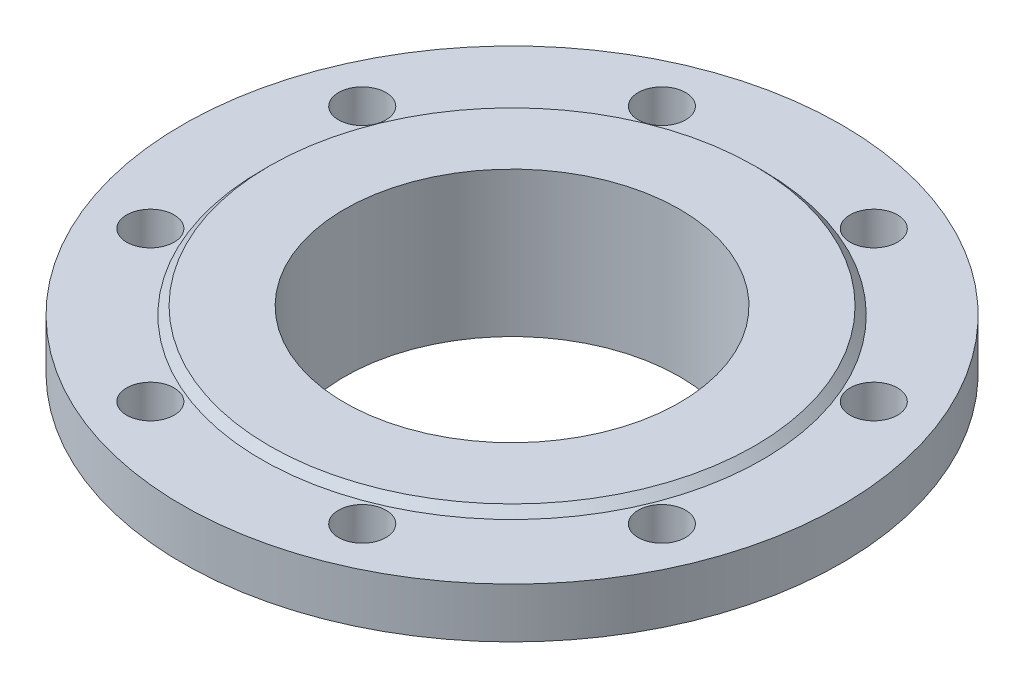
ISO-10303-21;
HEADER;
FILE_DESCRIPTION(('STEP AP214'),'2;1');
FILE_NAME('part.step','',(''),(''),'','','');
FILE_SCHEMA(('AUTOMOTIVE_DESIGN { 1 0 10303 214 1 1 1 1 }'));
ENDSEC;
DATA;
#1=APPLICATION_CONTEXT('core data for automotive mechanical design processes');
#2=APPLICATION_PROTOCOL_DEFINITION('international standard','automotive_design',2000,#1);
#3=PRODUCT_CONTEXT('',#1,'mechanical');
#4=PRODUCT('Part','Part','',(#3));
#5=PRODUCT_RELATED_PRODUCT_CATEGORY('part','',(#4));
#6=PRODUCT_DEFINITION_FORMATION('','',#4);
#7=PRODUCT_DEFINITION_CONTEXT('part definition',#1,'design');
#8=PRODUCT_DEFINITION('design','',#6,#7);
#9=PRODUCT_DEFINITION_SHAPE('','',#8);
#10=(LENGTH_UNIT() NAMED_UNIT(*) SI_UNIT(.MILLI.,.METRE.));
#11=(NAMED_UNIT(*) PLANE_ANGLE_UNIT() SI_UNIT($,.RADIAN.));
#12=(NAMED_UNIT(*) SI_UNIT($,.STERADIAN.) SOLID_ANGLE_UNIT());
#13=UNCERTAINTY_MEASURE_WITH_UNIT(LENGTH_MEASURE(1.E-05),#10,'distance_accuracy_value','');
#14=(GEOMETRIC_REPRESENTATION_CONTEXT(3) GLOBAL_UNCERTAINTY_ASSIGNED_CONTEXT((#13)) GLOBAL_UNIT_ASSIGNED_CONTEXT((#10,
#11,#12)) REPRESENTATION_CONTEXT('',''));
#15=CARTESIAN_POINT('',(0.,0.,0.));
#16=DIRECTION('',(0.,0.,1.));
#17=DIRECTION('',(1.,0.,0.));
#18=AXIS2_PLACEMENT_3D('',#15,#16,#17);
#19=CARTESIAN_POINT('',(-336.45,375.,0.));
#20=DIRECTION('',(0.,-1.,0.));
#21=DIRECTION('',(0.,0.,-1.));
#22=AXIS2_PLACEMENT_3D('',#19,#20,#21);
#23=PLANE('',#22);
#24=CARTESIAN_POINT('',(-400.,375.,0.));
#25=DIRECTION('',(0.,-1.,0.));
#26=DIRECTION('',(0.,0.,-1.));
#27=AXIS2_PLACEMENT_3D('',#24,#25,#26);
#28=CIRCLE('',#27,69.85);
#29=CARTESIAN_POINT('',(-400.,375.,-69.85));
#30=VERTEX_POINT('',#29);
#31=EDGE_CURVE('E12',#30,#30,#28,.T.);
#32=ORIENTED_EDGE('',*,*,#31,.T.);
#33=EDGE_LOOP('',(#32));
#34=FACE_BOUND('',#33,.T.);
#35=CARTESIAN_POINT('',(-400.,375.,0.));
#36=DIRECTION('',(0.,-1.,0.));
#37=DIRECTION('',(0.,0.,-1.));
#38=AXIS2_PLACEMENT_3D('',#35,#36,#37);
#39=CIRCLE('',#38,63.55);
#40=CARTESIAN_POINT('',(-400.,375.,-63.55));
#41=VERTEX_POINT('',#40);
#42=EDGE_CURVE('E73',#41,#41,#39,.T.);
#43=ORIENTED_EDGE('',*,*,#42,.F.);
#44=EDGE_LOOP('',(#43));
#45=FACE_BOUND('',#44,.T.);
#46=ADVANCED_FACE('F42',(#34,#45),#23,.T.);
#47=CARTESIAN_POINT('',(-400.,375.,0.));
#48=DIRECTION('',(0.,-1.,0.));
#49=DIRECTION('',(0.,0.,-1.));
#50=AXIS2_PLACEMENT_3D('',#47,#48,#49);
#51=CYLINDRICAL_SURFACE('',#50,69.85);
#52=CARTESIAN_POINT('',(-400.,387.,0.));
#53=DIRECTION('',(0.,-1.,0.));
#54=DIRECTION('',(0.,0.,-1.));
#55=AXIS2_PLACEMENT_3D('',#52,#53,#54);
#56=CIRCLE('',#55,69.85);
#57=CARTESIAN_POINT('',(-400.,387.,-69.85));
#58=VERTEX_POINT('',#57);
#59=EDGE_CURVE('E48',#58,#58,#56,.T.);
#60=ORIENTED_EDGE('',*,*,#59,.T.);
#61=EDGE_LOOP('',(#60));
#62=FACE_BOUND('',#61,.T.);
#63=ORIENTED_EDGE('',*,*,#31,.F.);
#64=EDGE_LOOP('',(#63));
#65=FACE_BOUND('',#64,.T.);
#66=ADVANCED_FACE('F166',(#62,#65),#51,.T.);
#67=CARTESIAN_POINT('',(-400.,387.,0.));
#68=DIRECTION('',(0.,1.,0.));
#69=DIRECTION('',(0.,0.,1.));
#70=AXIS2_PLACEMENT_3D('',#67,#68,#69);
#71=CONICAL_SURFACE('',#70,69.85,0.410910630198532);
#72=CARTESIAN_POINT('',(-400.,408.,0.));
#73=DIRECTION('',(0.,-1.,0.));
#74=DIRECTION('',(0.,0.,-1.));
#75=AXIS2_PLACEMENT_3D('',#72,#73,#74);
#76=CIRCLE('',#75,79.);
#77=CARTESIAN_POINT('',(-400.,408.,-79.));
#78=VERTEX_POINT('',#77);
#79=EDGE_CURVE('E52',#78,#78,#76,.T.);
#80=ORIENTED_EDGE('',*,*,#79,.T.);
#81=EDGE_LOOP('',(#80));
#82=FACE_BOUND('',#81,.T.);
#83=ORIENTED_EDGE('',*,*,#59,.F.);
#84=EDGE_LOOP('',(#83));
#85=FACE_BOUND('',#84,.T.);
#86=ADVANCED_FACE('F159',(#82,#85),#71,.T.);
#87=CARTESIAN_POINT('',(-321.,408.,0.));
#88=DIRECTION('',(0.,-1.,0.));
#89=DIRECTION('',(0.,0.,-1.));
#90=AXIS2_PLACEMENT_3D('',#87,#88,#89);
#91=PLANE('',#90);
#92=CARTESIAN_POINT('',(-359.818239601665,408.,-97.0073509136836));
#93=DIRECTION('',(0.,-1.,0.));
#94=DIRECTION('',(0.,0.,-1.));
#95=AXIS2_PLACEMENT_3D('',#92,#93,#94);
#96=CIRCLE('',#95,8.99999999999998);
#97=CARTESIAN_POINT('',(-359.818239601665,408.,-106.007350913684));
#98=VERTEX_POINT('',#97);
#99=EDGE_CURVE('E118',#98,#98,#96,.T.);
#100=ORIENTED_EDGE('',*,*,#99,.F.);
#101=EDGE_LOOP('',(#100));
#102=FACE_BOUND('',#101,.T.);
#103=CARTESIAN_POINT('',(-440.181760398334,408.,-97.007350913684));
#104=DIRECTION('',(0.,-1.,0.));
#105=DIRECTION('',(0.,0.,-1.));
#106=AXIS2_PLACEMENT_3D('',#103,#104,#105);
#107=CIRCLE('',#106,8.99999999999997);
#108=CARTESIAN_POINT('',(-440.181760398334,408.,-106.007350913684));
#109=VERTEX_POINT('',#108);
#110=EDGE_CURVE('E112',#109,#109,#107,.T.);
#111=ORIENTED_EDGE('',*,*,#110,.F.);
#112=EDGE_LOOP('',(#111));
#113=FACE_BOUND('',#112,.T.);
#114=CARTESIAN_POINT('',(-497.007350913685,408.,-40.1817603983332));
#115=DIRECTION('',(0.,-1.,0.));
#116=DIRECTION('',(0.,0.,-1.));
#117=AXIS2_PLACEMENT_3D('',#114,#115,#116);
#118=CIRCLE('',#117,8.99999999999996);
#119=CARTESIAN_POINT('',(-497.007350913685,408.,-49.1817603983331));
#120=VERTEX_POINT('',#119);
#121=EDGE_CURVE('E106',#120,#120,#118,.T.);
#122=ORIENTED_EDGE('',*,*,#121,.F.);
#123=EDGE_LOOP('',(#122));
#124=FACE_BOUND('',#123,.T.);
#125=CARTESIAN_POINT('',(-497.007350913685,408.,40.1817603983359));
#126=DIRECTION('',(0.,-1.,0.));
#127=DIRECTION('',(0.,0.,-1.));
#128=AXIS2_PLACEMENT_3D('',#125,#126,#127);
#129=CIRCLE('',#128,9.00000000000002);
#130=CARTESIAN_POINT('',(-497.007350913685,408.,31.1817603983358));
#131=VERTEX_POINT('',#130);
#132=EDGE_CURVE('E100',#131,#131,#129,.T.);
#133=ORIENTED_EDGE('',*,*,#132,.F.);
#134=EDGE_LOOP('',(#133));
#135=FACE_BOUND('',#134,.T.);
#136=CARTESIAN_POINT('',(-440.181760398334,408.,97.0073509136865));
#137=DIRECTION('',(0.,-1.,0.));
#138=DIRECTION('',(0.,0.,-1.));
#139=AXIS2_PLACEMENT_3D('',#136,#137,#138);
#140=CIRCLE('',#139,9.);
#141=CARTESIAN_POINT('',(-440.181760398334,408.,88.0073509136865));
#142=VERTEX_POINT('',#141);
#143=EDGE_CURVE('E94',#142,#142,#140,.T.);
#144=ORIENTED_EDGE('',*,*,#143,.F.);
#145=EDGE_LOOP('',(#144));
#146=FACE_BOUND('',#145,.T.);
#147=CARTESIAN_POINT('',(-359.818239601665,408.,97.0073509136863));
#148=DIRECTION('',(0.,-1.,0.));
#149=DIRECTION('',(0.,0.,-1.));
#150=AXIS2_PLACEMENT_3D('',#147,#148,#149);
#151=CIRCLE('',#150,8.99999999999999);
#152=CARTESIAN_POINT('',(-359.818239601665,408.,88.0073509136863));
#153=VERTEX_POINT('',#152);
#154=EDGE_CURVE('E88',#153,#153,#151,.T.);
#155=ORIENTED_EDGE('',*,*,#154,.F.);
#156=EDGE_LOOP('',(#155));
#157=FACE_BOUND('',#156,.T.);
#158=CARTESIAN_POINT('',(-302.992649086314,408.,40.1817603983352));
#159=DIRECTION('',(0.,-1.,0.));
#160=DIRECTION('',(0.,0.,-1.));
#161=AXIS2_PLACEMENT_3D('',#158,#159,#160);
#162=CIRCLE('',#161,9.);
#163=CARTESIAN_POINT('',(-302.992649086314,408.,31.1817603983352));
#164=VERTEX_POINT('',#163);
#165=EDGE_CURVE('E82',#164,#164,#162,.T.);
#166=ORIENTED_EDGE('',*,*,#165,.F.);
#167=EDGE_LOOP('',(#166));
#168=FACE_BOUND('',#167,.T.);
#169=CARTESIAN_POINT('',(-302.992649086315,408.,-40.1817603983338));
#170=DIRECTION('',(0.,-1.,0.));
#171=DIRECTION('',(0.,0.,-1.));
#172=AXIS2_PLACEMENT_3D('',#169,#170,#171);
#173=CIRCLE('',#172,8.99999999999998);
#174=CARTESIAN_POINT('',(-302.992649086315,408.,-49.1817603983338));
#175=VERTEX_POINT('',#174);
#176=EDGE_CURVE('E76',#175,#175,#173,.T.);
#177=ORIENTED_EDGE('',*,*,#176,.F.);
#178=EDGE_LOOP('',(#177));
#179=FACE_BOUND('',#178,.T.);
#180=CARTESIAN_POINT('',(-400.,408.,0.));
#181=DIRECTION('',(0.,-1.,0.));
#182=DIRECTION('',(0.,0.,-1.));
#183=AXIS2_PLACEMENT_3D('',#180,#181,#182);
#184=CIRCLE('',#183,125.);
#185=CARTESIAN_POINT('',(-400.,408.,-125.));
#186=VERTEX_POINT('',#185);
#187=EDGE_CURVE('E56',#186,#186,#184,.T.);
#188=ORIENTED_EDGE('',*,*,#187,.T.);
#189=EDGE_LOOP('',(#188));
#190=FACE_BOUND('',#189,.T.);
#191=ORIENTED_EDGE('',*,*,#79,.F.);
#192=EDGE_LOOP('',(#191));
#193=FACE_BOUND('',#192,.T.);
#194=ADVANCED_FACE('F153',(#102,#113,#124,#135,#146,#157,#168,#179,#190,#193),#91,.T.);
#195=CARTESIAN_POINT('',(-400.,375.,0.));
#196=DIRECTION('',(0.,-1.,0.));
#197=DIRECTION('',(0.,0.,-1.));
#198=AXIS2_PLACEMENT_3D('',#195,#196,#197);
#199=CYLINDRICAL_SURFACE('',#198,125.);
#200=CARTESIAN_POINT('',(-400.,427.,0.));
#201=DIRECTION('',(0.,-1.,0.));
#202=DIRECTION('',(0.,0.,-1.));
#203=AXIS2_PLACEMENT_3D('',#200,#201,#202);
#204=CIRCLE('',#203,125.);
#205=CARTESIAN_POINT('',(-400.,427.,-125.));
#206=VERTEX_POINT('',#205);
#207=EDGE_CURVE('E61',#206,#206,#204,.T.);
#208=ORIENTED_EDGE('',*,*,#207,.T.);
#209=EDGE_LOOP('',(#208));
#210=FACE_BOUND('',#209,.T.);
#211=ORIENTED_EDGE('',*,*,#187,.F.);
#212=EDGE_LOOP('',(#211));
#213=FACE_BOUND('',#212,.T.);
#214=ADVANCED_FACE('F131',(#210,#213),#199,.T.);
#215=CARTESIAN_POINT('',(-275.,427.,0.));
#216=DIRECTION('',(0.,1.,0.));
#217=DIRECTION('',(0.,0.,1.));
#218=AXIS2_PLACEMENT_3D('',#215,#216,#217);
#219=PLANE('',#218);
#220=CARTESIAN_POINT('',(-359.818239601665,427.,-97.0073509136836));
#221=DIRECTION('',(0.,1.,0.));
#222=DIRECTION('',(0.,0.,1.));
#223=AXIS2_PLACEMENT_3D('',#220,#221,#222);
#224=CIRCLE('',#223,8.99999999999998);
#225=CARTESIAN_POINT('',(-359.818239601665,427.,-88.0073509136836));
#226=VERTEX_POINT('',#225);
#227=EDGE_CURVE('E121',#226,#226,#224,.T.);
#228=ORIENTED_EDGE('',*,*,#227,.F.);
#229=EDGE_LOOP('',(#228));
#230=FACE_BOUND('',#229,.T.);
#231=CARTESIAN_POINT('',(-440.181760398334,427.,-97.007350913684));
#232=DIRECTION('',(0.,1.,0.));
#233=DIRECTION('',(0.,0.,1.));
#234=AXIS2_PLACEMENT_3D('',#231,#232,#233);
#235=CIRCLE('',#234,8.99999999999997);
#236=CARTESIAN_POINT('',(-440.181760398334,427.,-88.007350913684));
#237=VERTEX_POINT('',#236);
#238=EDGE_CURVE('E115',#237,#237,#235,.T.);
#239=ORIENTED_EDGE('',*,*,#238,.F.);
#240=EDGE_LOOP('',(#239));
#241=FACE_BOUND('',#240,.T.);
#242=CARTESIAN_POINT('',(-497.007350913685,427.,-40.1817603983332));
#243=DIRECTION('',(0.,1.,0.));
#244=DIRECTION('',(0.,0.,1.));
#245=AXIS2_PLACEMENT_3D('',#242,#243,#244);
#246=CIRCLE('',#245,8.99999999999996);
#247=CARTESIAN_POINT('',(-497.007350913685,427.,-31.1817603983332));
#248=VERTEX_POINT('',#247);
#249=EDGE_CURVE('E109',#248,#248,#246,.T.);
#250=ORIENTED_EDGE('',*,*,#249,.F.);
#251=EDGE_LOOP('',(#250));
#252=FACE_BOUND('',#251,.T.);
#253=CARTESIAN_POINT('',(-497.007350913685,427.,40.1817603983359));
#254=DIRECTION('',(0.,1.,0.));
#255=DIRECTION('',(0.,0.,1.));
#256=AXIS2_PLACEMENT_3D('',#253,#254,#255);
#257=CIRCLE('',#256,9.00000000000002);
#258=CARTESIAN_POINT('',(-497.007350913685,427.,49.1817603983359));
#259=VERTEX_POINT('',#258);
#260=EDGE_CURVE('E103',#259,#259,#257,.T.);
#261=ORIENTED_EDGE('',*,*,#260,.F.);
#262=EDGE_LOOP('',(#261));
#263=FACE_BOUND('',#262,.T.);
#264=CARTESIAN_POINT('',(-440.181760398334,427.,97.0073509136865));
#265=DIRECTION('',(0.,1.,0.));
#266=DIRECTION('',(0.,0.,1.));
#267=AXIS2_PLACEMENT_3D('',#264,#265,#266);
#268=CIRCLE('',#267,9.);
#269=CARTESIAN_POINT('',(-440.181760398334,427.,106.007350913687));
#270=VERTEX_POINT('',#269);
#271=EDGE_CURVE('E97',#270,#270,#268,.T.);
#272=ORIENTED_EDGE('',*,*,#271,.F.);
#273=EDGE_LOOP('',(#272));
#274=FACE_BOUND('',#273,.T.);
#275=CARTESIAN_POINT('',(-359.818239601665,427.,97.0073509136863));
#276=DIRECTION('',(0.,1.,0.));
#277=DIRECTION('',(0.,0.,1.));
#278=AXIS2_PLACEMENT_3D('',#275,#276,#277);
#279=CIRCLE('',#278,8.99999999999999);
#280=CARTESIAN_POINT('',(-359.818239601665,427.,106.007350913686));
#281=VERTEX_POINT('',#280);
#282=EDGE_CURVE('E91',#281,#281,#279,.T.);
#283=ORIENTED_EDGE('',*,*,#282,.F.);
#284=EDGE_LOOP('',(#283));
#285=FACE_BOUND('',#284,.T.);
#286=CARTESIAN_POINT('',(-302.992649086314,427.,40.1817603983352));
#287=DIRECTION('',(0.,1.,0.));
#288=DIRECTION('',(0.,0.,1.));
#289=AXIS2_PLACEMENT_3D('',#286,#287,#288);
#290=CIRCLE('',#289,9.);
#291=CARTESIAN_POINT('',(-302.992649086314,427.,49.1817603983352));
#292=VERTEX_POINT('',#291);
#293=EDGE_CURVE('E85',#292,#292,#290,.T.);
#294=ORIENTED_EDGE('',*,*,#293,.F.);
#295=EDGE_LOOP('',(#294));
#296=FACE_BOUND('',#295,.T.);
#297=CARTESIAN_POINT('',(-302.992649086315,427.,-40.1817603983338));
#298=DIRECTION('',(0.,1.,0.));
#299=DIRECTION('',(0.,0.,1.));
#300=AXIS2_PLACEMENT_3D('',#297,#298,#299);
#301=CIRCLE('',#300,8.99999999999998);
#302=CARTESIAN_POINT('',(-302.992649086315,427.,-31.1817603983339));
#303=VERTEX_POINT('',#302);
#304=EDGE_CURVE('E79',#303,#303,#301,.T.);
#305=ORIENTED_EDGE('',*,*,#304,.F.);
#306=EDGE_LOOP('',(#305));
#307=FACE_BOUND('',#306,.T.);
#308=CARTESIAN_POINT('',(-400.,427.,0.));
#309=DIRECTION('',(0.,-1.,0.));
#310=DIRECTION('',(0.,0.,-1.));
#311=AXIS2_PLACEMENT_3D('',#308,#309,#310);
#312=CIRCLE('',#311,94.9999999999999);
#313=CARTESIAN_POINT('',(-400.,427.,-94.9999999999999));
#314=VERTEX_POINT('',#313);
#315=EDGE_CURVE('E64',#314,#314,#312,.T.);
#316=ORIENTED_EDGE('',*,*,#315,.T.);
#317=EDGE_LOOP('',(#316));
#318=FACE_BOUND('',#317,.T.);
#319=ORIENTED_EDGE('',*,*,#207,.F.);
#320=EDGE_LOOP('',(#319));
#321=FACE_BOUND('',#320,.T.);
#322=ADVANCED_FACE('F127',(#230,#241,#252,#263,#274,#285,#296,#307,#318,#321),#219,.T.);
#323=CARTESIAN_POINT('',(-400.,427.,0.));
#324=DIRECTION('',(0.,-1.,0.));
#325=DIRECTION('',(0.,0.,-1.));
#326=AXIS2_PLACEMENT_3D('',#323,#324,#325);
#327=CONICAL_SURFACE('',#326,94.9999999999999,0.785398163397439);
#328=CARTESIAN_POINT('',(-400.,430.,0.));
#329=DIRECTION('',(0.,-1.,0.));
#330=DIRECTION('',(0.,0.,-1.));
#331=AXIS2_PLACEMENT_3D('',#328,#329,#330);
#332=CIRCLE('',#331,92.);
#333=CARTESIAN_POINT('',(-400.,430.,-92.));
#334=VERTEX_POINT('',#333);
#335=EDGE_CURVE('E67',#334,#334,#332,.T.);
#336=ORIENTED_EDGE('',*,*,#335,.T.);
#337=EDGE_LOOP('',(#336));
#338=FACE_BOUND('',#337,.T.);
#339=ORIENTED_EDGE('',*,*,#315,.F.);
#340=EDGE_LOOP('',(#339));
#341=FACE_BOUND('',#340,.T.);
#342=ADVANCED_FACE('F130',(#338,#341),#327,.T.);
#343=CARTESIAN_POINT('',(-308.,430.,0.));
#344=DIRECTION('',(0.,1.,0.));
#345=DIRECTION('',(0.,0.,1.));
#346=AXIS2_PLACEMENT_3D('',#343,#344,#345);
#347=PLANE('',#346);
#348=CARTESIAN_POINT('',(-400.,430.,0.));
#349=DIRECTION('',(0.,-1.,0.));
#350=DIRECTION('',(0.,0.,-1.));
#351=AXIS2_PLACEMENT_3D('',#348,#349,#350);
#352=CIRCLE('',#351,63.55);
#353=CARTESIAN_POINT('',(-400.,430.,-63.55));
#354=VERTEX_POINT('',#353);
#355=EDGE_CURVE('E70',#354,#354,#352,.T.);
#356=ORIENTED_EDGE('',*,*,#355,.T.);
#357=EDGE_LOOP('',(#356));
#358=FACE_BOUND('',#357,.T.);
#359=ORIENTED_EDGE('',*,*,#335,.F.);
#360=EDGE_LOOP('',(#359));
#361=FACE_BOUND('',#360,.T.);
#362=ADVANCED_FACE('F181',(#358,#361),#347,.T.);
#363=CARTESIAN_POINT('',(-400.,375.,0.));
#364=DIRECTION('',(0.,-1.,0.));
#365=DIRECTION('',(0.,0.,-1.));
#366=AXIS2_PLACEMENT_3D('',#363,#364,#365);
#367=CYLINDRICAL_SURFACE('',#366,63.55);
#368=ORIENTED_EDGE('',*,*,#42,.T.);
#369=EDGE_LOOP('',(#368));
#370=FACE_BOUND('',#369,.T.);
#371=ORIENTED_EDGE('',*,*,#355,.F.);
#372=EDGE_LOOP('',(#371));
#373=FACE_BOUND('',#372,.T.);
#374=ADVANCED_FACE('F177',(#370,#373),#367,.F.);
#375=CARTESIAN_POINT('',(-302.992649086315,375.,-40.1817603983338));
#376=DIRECTION('',(0.,1.,0.));
#377=DIRECTION('',(0.,0.,1.));
#378=AXIS2_PLACEMENT_3D('',#375,#376,#377);
#379=CYLINDRICAL_SURFACE('',#378,8.99999999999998);
#380=ORIENTED_EDGE('',*,*,#176,.T.);
#381=EDGE_LOOP('',(#380));
#382=FACE_BOUND('',#381,.T.);
#383=ORIENTED_EDGE('',*,*,#304,.T.);
#384=EDGE_LOOP('',(#383));
#385=FACE_BOUND('',#384,.T.);
#386=ADVANCED_FACE('F180',(#382,#385),#379,.F.);
#387=CARTESIAN_POINT('',(-302.992649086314,375.,40.1817603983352));
#388=DIRECTION('',(0.,1.,0.));
#389=DIRECTION('',(0.,0.,1.));
#390=AXIS2_PLACEMENT_3D('',#387,#388,#389);
#391=CYLINDRICAL_SURFACE('',#390,9.);
#392=ORIENTED_EDGE('',*,*,#165,.T.);
#393=EDGE_LOOP('',(#392));
#394=FACE_BOUND('',#393,.T.);
#395=ORIENTED_EDGE('',*,*,#293,.T.);
#396=EDGE_LOOP('',(#395));
#397=FACE_BOUND('',#396,.T.);
#398=ADVANCED_FACE('F198',(#394,#397),#391,.F.);
#399=CARTESIAN_POINT('',(-359.818239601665,375.,97.0073509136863));
#400=DIRECTION('',(0.,1.,0.));
#401=DIRECTION('',(0.,0.,1.));
#402=AXIS2_PLACEMENT_3D('',#399,#400,#401);
#403=CYLINDRICAL_SURFACE('',#402,8.99999999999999);
#404=ORIENTED_EDGE('',*,*,#154,.T.);
#405=EDGE_LOOP('',(#404));
#406=FACE_BOUND('',#405,.T.);
#407=ORIENTED_EDGE('',*,*,#282,.T.);
#408=EDGE_LOOP('',(#407));
#409=FACE_BOUND('',#408,.T.);
#410=ADVANCED_FACE('F202',(#406,#409),#403,.F.);
#411=CARTESIAN_POINT('',(-440.181760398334,375.,97.0073509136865));
#412=DIRECTION('',(0.,1.,0.));
#413=DIRECTION('',(0.,0.,1.));
#414=AXIS2_PLACEMENT_3D('',#411,#412,#413);
#415=CYLINDRICAL_SURFACE('',#414,9.);
#416=ORIENTED_EDGE('',*,*,#143,.T.);
#417=EDGE_LOOP('',(#416));
#418=FACE_BOUND('',#417,.T.);
#419=ORIENTED_EDGE('',*,*,#271,.T.);
#420=EDGE_LOOP('',(#419));
#421=FACE_BOUND('',#420,.T.);
#422=ADVANCED_FACE('F206',(#418,#421),#415,.F.);
#423=CARTESIAN_POINT('',(-497.007350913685,375.,40.1817603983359));
#424=DIRECTION('',(0.,1.,0.));
#425=DIRECTION('',(0.,0.,1.));
#426=AXIS2_PLACEMENT_3D('',#423,#424,#425);
#427=CYLINDRICAL_SURFACE('',#426,9.00000000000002);
#428=ORIENTED_EDGE('',*,*,#132,.T.);
#429=EDGE_LOOP('',(#428));
#430=FACE_BOUND('',#429,.T.);
#431=ORIENTED_EDGE('',*,*,#260,.T.);
#432=EDGE_LOOP('',(#431));
#433=FACE_BOUND('',#432,.T.);
#434=ADVANCED_FACE('F210',(#430,#433),#427,.F.);
#435=CARTESIAN_POINT('',(-497.007350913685,375.,-40.1817603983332));
#436=DIRECTION('',(0.,1.,0.));
#437=DIRECTION('',(0.,0.,1.));
#438=AXIS2_PLACEMENT_3D('',#435,#436,#437);
#439=CYLINDRICAL_SURFACE('',#438,8.99999999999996);
#440=ORIENTED_EDGE('',*,*,#121,.T.);
#441=EDGE_LOOP('',(#440));
#442=FACE_BOUND('',#441,.T.);
#443=ORIENTED_EDGE('',*,*,#249,.T.);
#444=EDGE_LOOP('',(#443));
#445=FACE_BOUND('',#444,.T.);
#446=ADVANCED_FACE('F214',(#442,#445),#439,.F.);
#447=CARTESIAN_POINT('',(-440.181760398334,375.,-97.007350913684));
#448=DIRECTION('',(0.,1.,0.));
#449=DIRECTION('',(0.,0.,1.));
#450=AXIS2_PLACEMENT_3D('',#447,#448,#449);
#451=CYLINDRICAL_SURFACE('',#450,8.99999999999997);
#452=ORIENTED_EDGE('',*,*,#110,.T.);
#453=EDGE_LOOP('',(#452));
#454=FACE_BOUND('',#453,.T.);
#455=ORIENTED_EDGE('',*,*,#238,.T.);
#456=EDGE_LOOP('',(#455));
#457=FACE_BOUND('',#456,.T.);
#458=ADVANCED_FACE('F218',(#454,#457),#451,.F.);
#459=CARTESIAN_POINT('',(-359.818239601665,375.,-97.0073509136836));
#460=DIRECTION('',(0.,1.,0.));
#461=DIRECTION('',(0.,0.,1.));
#462=AXIS2_PLACEMENT_3D('',#459,#460,#461);
#463=CYLINDRICAL_SURFACE('',#462,8.99999999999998);
#464=ORIENTED_EDGE('',*,*,#99,.T.);
#465=EDGE_LOOP('',(#464));
#466=FACE_BOUND('',#465,.T.);
#467=ORIENTED_EDGE('',*,*,#227,.T.);
#468=EDGE_LOOP('',(#467));
#469=FACE_BOUND('',#468,.T.);
#470=ADVANCED_FACE('F125',(#466,#469),#463,.F.);
#471=CLOSED_SHELL('',(#46,#66,#86,#194,#214,#322,#342,#362,#374,#386,#398,#410,#422,#434,#446,
#458,#470));
#472=MANIFOLD_SOLID_BREP('B2',#471);
#473=ADVANCED_BREP_SHAPE_REPRESENTATION('',(#18,#472),#14);
#474=SHAPE_DEFINITION_REPRESENTATION(#9,#473);
ENDSEC;
END-ISO-10303-21;
